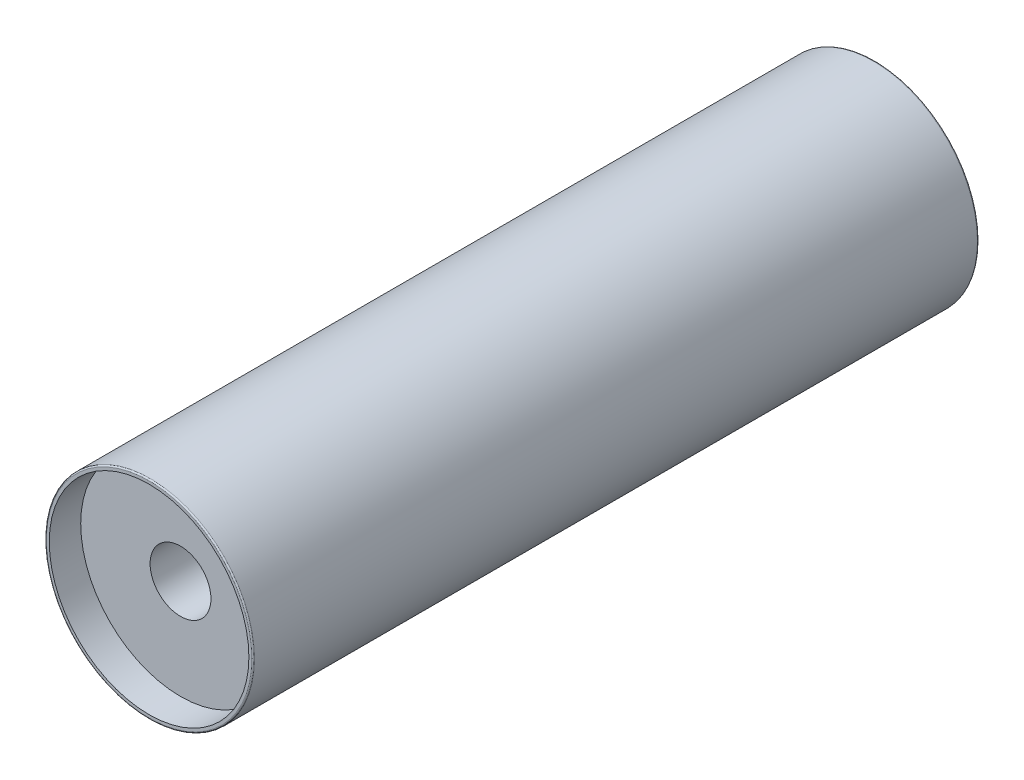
from build123d import *

# Parameters (mm, degrees)
SKETCH1_R           = 19.85
BASE_EXTRUDE_DEPTH  = 69.25
SKETCH2_R           = 19.05
STROKECHAMBER_DEPTH = 40.6
RODBORE_DEPTH       = 75.723540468
RODBORE_DEPTH_BACK  = 75.723540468
SKETCH3_R           = 5.80625
FILLET1_R           = 0.25
SKETCH4_R           = 19.05
CUT_EXTRUDE1_DEPTH  = 6


with BuildPart() as part:
    # Sketch1 → Base-Extrude (new, symmetric)
    with BuildSketch(Plane.XY):
        Circle(SKETCH1_R)
    extrude(amount=BASE_EXTRUDE_DEPTH, both=True)

    # Sketch2 → StrokeChamber (cut, symmetric)
    with BuildSketch(Plane.XY):
        Circle(SKETCH2_R)
    extrude(amount=STROKECHAMBER_DEPTH, both=True, mode=Mode.SUBTRACT)

    # Sketch3 → RodBore (cut, two sides: drawn at the far end of the back side and taken through both)
    with BuildSketch(Plane.XY.offset(-RODBORE_DEPTH_BACK)):
        Circle(SKETCH3_R)
    extrude(amount=RODBORE_DEPTH + RODBORE_DEPTH_BACK, mode=Mode.SUBTRACT)

    # Fillet1
    fillet1_edges = [part.edges().sort_by_distance(p)[0] for p in [
        (-19.85, 0, -69.25),
        (-19.85, 0, 69.25),
    ]]
    fillet(fillet1_edges, radius=FILLET1_R)

    # Sketch4 → Cut-Extrude1 (cut)
    with BuildSketch(Plane.XY.offset(69.25)):
        Circle(SKETCH4_R)
    cut_extrude1 = extrude(amount=-CUT_EXTRUDE1_DEPTH, mode=Mode.SUBTRACT)

    # Mirror1: Cut-Extrude1 across plane
    add(cut_extrude1.mirror(Plane.XY), mode=Mode.SUBTRACT)


solid = part.part
